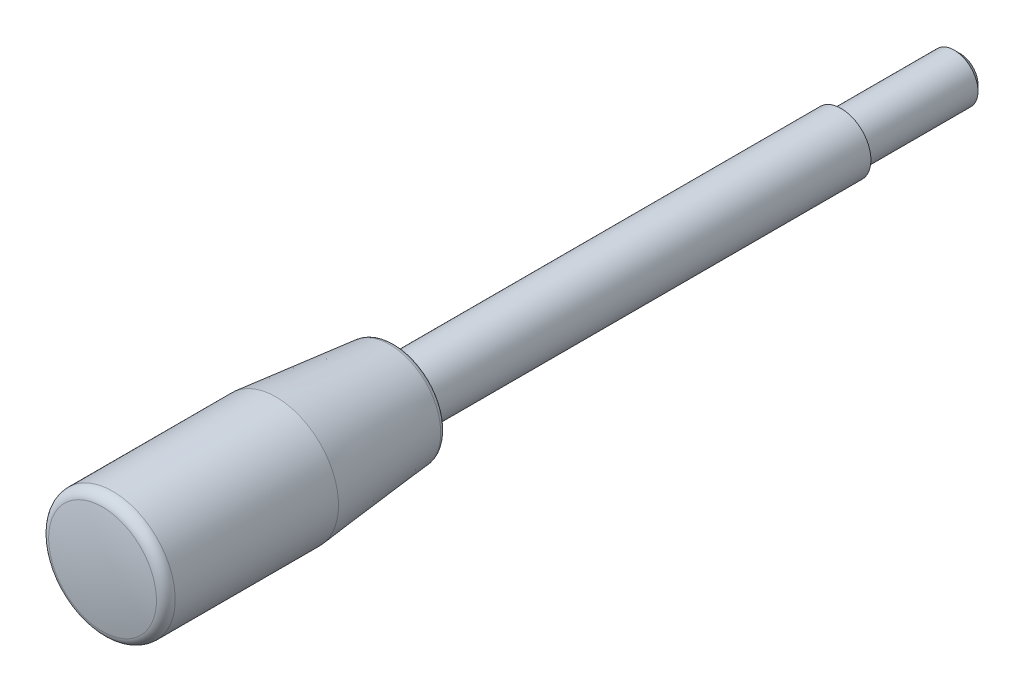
ISO-10303-21;
HEADER;
FILE_DESCRIPTION(('STEP AP214'),'2;1');
FILE_NAME('part.step','',(''),(''),'','','');
FILE_SCHEMA(('AUTOMOTIVE_DESIGN { 1 0 10303 214 1 1 1 1 }'));
ENDSEC;
DATA;
#1=APPLICATION_CONTEXT('core data for automotive mechanical design processes');
#2=APPLICATION_PROTOCOL_DEFINITION('international standard','automotive_design',2000,#1);
#3=PRODUCT_CONTEXT('',#1,'mechanical');
#4=PRODUCT('Part','Part','',(#3));
#5=PRODUCT_RELATED_PRODUCT_CATEGORY('part','',(#4));
#6=PRODUCT_DEFINITION_FORMATION('','',#4);
#7=PRODUCT_DEFINITION_CONTEXT('part definition',#1,'design');
#8=PRODUCT_DEFINITION('design','',#6,#7);
#9=PRODUCT_DEFINITION_SHAPE('','',#8);
#10=(LENGTH_UNIT() NAMED_UNIT(*) SI_UNIT(.MILLI.,.METRE.));
#11=(NAMED_UNIT(*) PLANE_ANGLE_UNIT() SI_UNIT($,.RADIAN.));
#12=(NAMED_UNIT(*) SI_UNIT($,.STERADIAN.) SOLID_ANGLE_UNIT());
#13=UNCERTAINTY_MEASURE_WITH_UNIT(LENGTH_MEASURE(1.E-05),#10,'distance_accuracy_value','');
#14=(GEOMETRIC_REPRESENTATION_CONTEXT(3) GLOBAL_UNCERTAINTY_ASSIGNED_CONTEXT((#13)) GLOBAL_UNIT_ASSIGNED_CONTEXT((#10,
#11,#12)) REPRESENTATION_CONTEXT('',''));
#15=CARTESIAN_POINT('',(0.,0.,0.));
#16=DIRECTION('',(0.,0.,1.));
#17=DIRECTION('',(1.,0.,0.));
#18=AXIS2_PLACEMENT_3D('',#15,#16,#17);
#19=CARTESIAN_POINT('',(0.,0.,-32.9427195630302));
#20=DIRECTION('',(0.,0.,-1.));
#21=DIRECTION('',(-1.,0.,0.));
#22=AXIS2_PLACEMENT_3D('',#19,#20,#21);
#23=CYLINDRICAL_SURFACE('',#22,4.);
#24=CARTESIAN_POINT('',(0.,0.,-19.));
#25=DIRECTION('',(0.,0.,-1.));
#26=DIRECTION('',(-1.,0.,0.));
#27=AXIS2_PLACEMENT_3D('',#24,#25,#26);
#28=CIRCLE('',#27,4.);
#29=CARTESIAN_POINT('',(-4.,0.,-19.));
#30=VERTEX_POINT('',#29);
#31=EDGE_CURVE('E8',#30,#30,#28,.T.);
#32=ORIENTED_EDGE('',*,*,#31,.F.);
#33=EDGE_LOOP('',(#32));
#34=FACE_BOUND('',#33,.T.);
#35=CARTESIAN_POINT('',(0.,0.,0.));
#36=DIRECTION('',(0.,0.,-1.));
#37=DIRECTION('',(-1.,0.,0.));
#38=AXIS2_PLACEMENT_3D('',#35,#36,#37);
#39=CIRCLE('',#38,4.);
#40=CARTESIAN_POINT('',(-4.,0.,0.));
#41=VERTEX_POINT('',#40);
#42=EDGE_CURVE('E46',#41,#41,#39,.T.);
#43=ORIENTED_EDGE('',*,*,#42,.T.);
#44=EDGE_LOOP('',(#43));
#45=FACE_BOUND('',#44,.T.);
#46=ADVANCED_FACE('F12',(#34,#45),#23,.T.);
#47=CARTESIAN_POINT('',(0.,0.,-19.));
#48=DIRECTION('',(0.,0.,1.));
#49=DIRECTION('',(1.,0.,0.));
#50=AXIS2_PLACEMENT_3D('',#47,#48,#49);
#51=CONICAL_SURFACE('',#50,4.,0.785398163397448);
#52=CARTESIAN_POINT('',(0.,0.,-20.));
#53=DIRECTION('',(0.,0.,-1.));
#54=DIRECTION('',(-1.,0.,0.));
#55=AXIS2_PLACEMENT_3D('',#52,#53,#54);
#56=CIRCLE('',#55,3.);
#57=CARTESIAN_POINT('',(-3.,0.,-20.));
#58=VERTEX_POINT('',#57);
#59=EDGE_CURVE('E18',#58,#58,#56,.T.);
#60=ORIENTED_EDGE('',*,*,#59,.F.);
#61=EDGE_LOOP('',(#60));
#62=FACE_BOUND('',#61,.T.);
#63=ORIENTED_EDGE('',*,*,#31,.T.);
#64=EDGE_LOOP('',(#63));
#65=FACE_BOUND('',#64,.T.);
#66=ADVANCED_FACE('F102',(#62,#65),#51,.T.);
#67=CARTESIAN_POINT('',(0.,3.,-20.));
#68=DIRECTION('',(0.,0.,1.));
#69=DIRECTION('',(1.,0.,0.));
#70=AXIS2_PLACEMENT_3D('',#67,#68,#69);
#71=PLANE('',#70);
#72=ORIENTED_EDGE('',*,*,#59,.T.);
#73=EDGE_LOOP('',(#72));
#74=FACE_BOUND('',#73,.T.);
#75=ADVANCED_FACE('F95',(#74),#71,.F.);
#76=CARTESIAN_POINT('',(0.,0.,75.));
#77=DIRECTION('',(-1.,0.,0.));
#78=DIRECTION('',(0.,0.,1.));
#79=AXIS2_PLACEMENT_3D('',#76,#77,#78);
#80=SPHERICAL_SURFACE('',#79,50.);
#81=CARTESIAN_POINT('',(0.,0.,75.));
#82=DIRECTION('',(0.,0.,-1.));
#83=DIRECTION('',(-1.,0.,0.));
#84=AXIS2_PLACEMENT_3D('',#81,#82,#83);
#85=SPHERICAL_SURFACE('',#84,50.);
#86=CARTESIAN_POINT('',(0.,0.,124.170957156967));
#87=DIRECTION('',(0.,0.,-1.));
#88=DIRECTION('',(-1.,0.,0.));
#89=AXIS2_PLACEMENT_3D('',#86,#87,#88);
#90=CIRCLE('',#89,9.06735751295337);
#91=CARTESIAN_POINT('',(-9.06735751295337,0.,124.170957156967));
#92=VERTEX_POINT('',#91);
#93=EDGE_CURVE('E22',#92,#92,#90,.T.);
#94=ORIENTED_EDGE('',*,*,#93,.F.);
#95=EDGE_LOOP('',(#94));
#96=FACE_BOUND('',#95,.T.);
#97=ADVANCED_FACE('F90',(#96),#85,.T.);
#98=CARTESIAN_POINT('',(0.,0.,122.449973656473));
#99=DIRECTION('',(0.,0.,-1.));
#100=DIRECTION('',(-1.,0.,0.));
#101=AXIS2_PLACEMENT_3D('',#98,#99,#100);
#102=TOROIDAL_SURFACE('',#101,8.75,1.75);
#103=CARTESIAN_POINT('',(0.,0.,122.449973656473));
#104=DIRECTION('',(0.,0.,-1.));
#105=DIRECTION('',(-1.,0.,0.));
#106=AXIS2_PLACEMENT_3D('',#103,#104,#105);
#107=CIRCLE('',#106,10.5);
#108=CARTESIAN_POINT('',(-10.5,0.,122.449973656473));
#109=VERTEX_POINT('',#108);
#110=EDGE_CURVE('E26',#109,#109,#107,.T.);
#111=ORIENTED_EDGE('',*,*,#110,.F.);
#112=EDGE_LOOP('',(#111));
#113=FACE_BOUND('',#112,.T.);
#114=ORIENTED_EDGE('',*,*,#93,.T.);
#115=EDGE_LOOP('',(#114));
#116=FACE_BOUND('',#115,.T.);
#117=ADVANCED_FACE('F84',(#113,#116),#102,.T.);
#118=CARTESIAN_POINT('',(0.,0.,-32.9427195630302));
#119=DIRECTION('',(0.,0.,-1.));
#120=DIRECTION('',(-1.,0.,0.));
#121=AXIS2_PLACEMENT_3D('',#118,#119,#120);
#122=CYLINDRICAL_SURFACE('',#121,10.5);
#123=CARTESIAN_POINT('',(0.,0.,95.));
#124=DIRECTION('',(0.,0.,-1.));
#125=DIRECTION('',(-1.,0.,0.));
#126=AXIS2_PLACEMENT_3D('',#123,#124,#125);
#127=CIRCLE('',#126,10.5);
#128=CARTESIAN_POINT('',(-10.5,0.,95.));
#129=VERTEX_POINT('',#128);
#130=EDGE_CURVE('E31',#129,#129,#127,.T.);
#131=ORIENTED_EDGE('',*,*,#130,.F.);
#132=EDGE_LOOP('',(#131));
#133=FACE_BOUND('',#132,.T.);
#134=ORIENTED_EDGE('',*,*,#110,.T.);
#135=EDGE_LOOP('',(#134));
#136=FACE_BOUND('',#135,.T.);
#137=ADVANCED_FACE('F78',(#133,#136),#122,.T.);
#138=CARTESIAN_POINT('',(0.,0.,95.));
#139=DIRECTION('',(0.,0.,1.));
#140=DIRECTION('',(1.,0.,0.));
#141=AXIS2_PLACEMENT_3D('',#138,#139,#140);
#142=CONICAL_SURFACE('',#141,10.5,0.0996686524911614);
#143=CARTESIAN_POINT('',(0.,0.,75.9004962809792));
#144=DIRECTION('',(0.,0.,-1.));
#145=DIRECTION('',(-1.,0.,0.));
#146=AXIS2_PLACEMENT_3D('',#143,#144,#145);
#147=CIRCLE('',#146,8.5900496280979);
#148=CARTESIAN_POINT('',(-8.5900496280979,0.,75.9004962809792));
#149=VERTEX_POINT('',#148);
#150=EDGE_CURVE('E34',#149,#149,#147,.T.);
#151=ORIENTED_EDGE('',*,*,#150,.F.);
#152=EDGE_LOOP('',(#151));
#153=FACE_BOUND('',#152,.T.);
#154=ORIENTED_EDGE('',*,*,#130,.T.);
#155=EDGE_LOOP('',(#154));
#156=FACE_BOUND('',#155,.T.);
#157=ADVANCED_FACE('F72',(#153,#156),#142,.T.);
#158=CARTESIAN_POINT('',(0.,0.,76.));
#159=DIRECTION('',(0.,0.,-1.));
#160=DIRECTION('',(-1.,0.,0.));
#161=AXIS2_PLACEMENT_3D('',#158,#159,#160);
#162=TOROIDAL_SURFACE('',#161,7.59501243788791,0.999999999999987);
#163=CARTESIAN_POINT('',(0.,0.,75.));
#164=DIRECTION('',(0.,0.,-1.));
#165=DIRECTION('',(-1.,0.,0.));
#166=AXIS2_PLACEMENT_3D('',#163,#164,#165);
#167=CIRCLE('',#166,7.59501243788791);
#168=CARTESIAN_POINT('',(-7.59501243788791,0.,75.));
#169=VERTEX_POINT('',#168);
#170=EDGE_CURVE('E37',#169,#169,#167,.T.);
#171=ORIENTED_EDGE('',*,*,#170,.F.);
#172=EDGE_LOOP('',(#171));
#173=FACE_BOUND('',#172,.T.);
#174=ORIENTED_EDGE('',*,*,#150,.T.);
#175=EDGE_LOOP('',(#174));
#176=FACE_BOUND('',#175,.T.);
#177=ADVANCED_FACE('F66',(#173,#176),#162,.T.);
#178=CARTESIAN_POINT('',(0.,7.59501243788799,75.));
#179=DIRECTION('',(0.,0.,1.));
#180=DIRECTION('',(1.,0.,0.));
#181=AXIS2_PLACEMENT_3D('',#178,#179,#180);
#182=PLANE('',#181);
#183=CARTESIAN_POINT('',(0.,0.,75.));
#184=DIRECTION('',(0.,0.,-1.));
#185=DIRECTION('',(-1.,0.,0.));
#186=AXIS2_PLACEMENT_3D('',#183,#184,#185);
#187=CIRCLE('',#186,5.);
#188=CARTESIAN_POINT('',(-5.,0.,75.));
#189=VERTEX_POINT('',#188);
#190=EDGE_CURVE('E40',#189,#189,#187,.T.);
#191=ORIENTED_EDGE('',*,*,#190,.F.);
#192=EDGE_LOOP('',(#191));
#193=FACE_BOUND('',#192,.T.);
#194=ORIENTED_EDGE('',*,*,#170,.T.);
#195=EDGE_LOOP('',(#194));
#196=FACE_BOUND('',#195,.T.);
#197=ADVANCED_FACE('F60',(#193,#196),#182,.F.);
#198=CARTESIAN_POINT('',(0.,0.,-32.9427195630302));
#199=DIRECTION('',(0.,0.,-1.));
#200=DIRECTION('',(-1.,0.,0.));
#201=AXIS2_PLACEMENT_3D('',#198,#199,#200);
#202=CYLINDRICAL_SURFACE('',#201,5.);
#203=CARTESIAN_POINT('',(0.,0.,0.));
#204=DIRECTION('',(0.,0.,-1.));
#205=DIRECTION('',(-1.,0.,0.));
#206=AXIS2_PLACEMENT_3D('',#203,#204,#205);
#207=CIRCLE('',#206,5.);
#208=CARTESIAN_POINT('',(-5.,0.,0.));
#209=VERTEX_POINT('',#208);
#210=EDGE_CURVE('E43',#209,#209,#207,.T.);
#211=ORIENTED_EDGE('',*,*,#210,.F.);
#212=EDGE_LOOP('',(#211));
#213=FACE_BOUND('',#212,.T.);
#214=ORIENTED_EDGE('',*,*,#190,.T.);
#215=EDGE_LOOP('',(#214));
#216=FACE_BOUND('',#215,.T.);
#217=ADVANCED_FACE('F54',(#213,#216),#202,.T.);
#218=CARTESIAN_POINT('',(0.,5.,0.));
#219=DIRECTION('',(0.,0.,1.));
#220=DIRECTION('',(1.,0.,0.));
#221=AXIS2_PLACEMENT_3D('',#218,#219,#220);
#222=PLANE('',#221);
#223=ORIENTED_EDGE('',*,*,#42,.F.);
#224=EDGE_LOOP('',(#223));
#225=FACE_BOUND('',#224,.T.);
#226=ORIENTED_EDGE('',*,*,#210,.T.);
#227=EDGE_LOOP('',(#226));
#228=FACE_BOUND('',#227,.T.);
#229=ADVANCED_FACE('F51',(#225,#228),#222,.F.);
#230=CLOSED_SHELL('',(#46,#66,#75,#97,#117,#137,#157,#177,#197,#217,#229));
#231=MANIFOLD_SOLID_BREP('B1',#230);
#232=ADVANCED_BREP_SHAPE_REPRESENTATION('',(#18,#231),#14);
#233=SHAPE_DEFINITION_REPRESENTATION(#9,#232);
ENDSEC;
END-ISO-10303-21;
